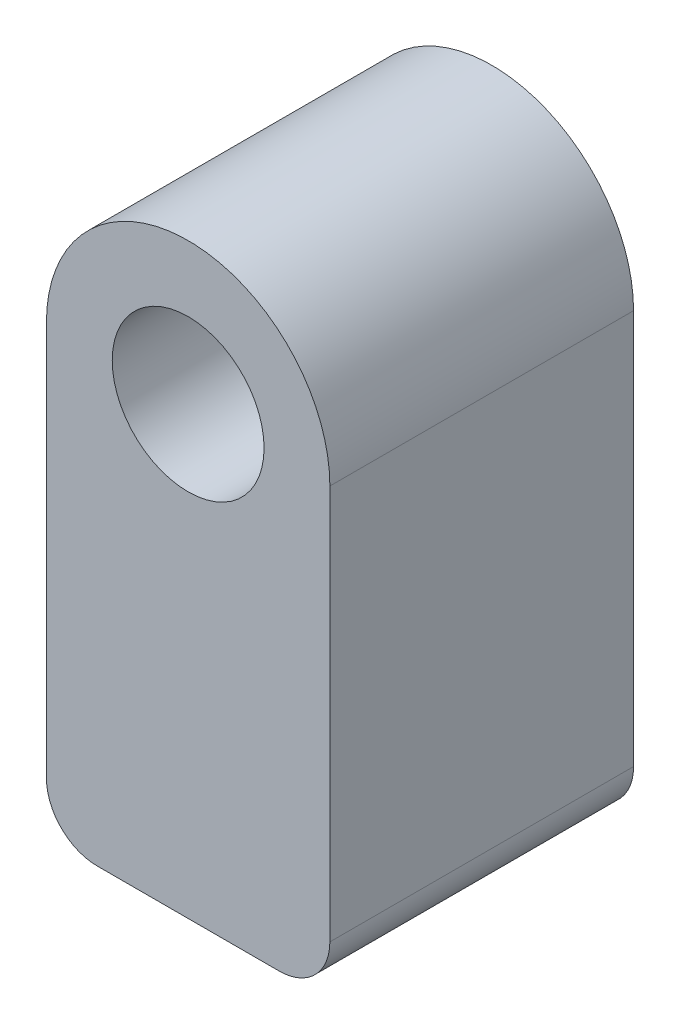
from build123d import *

# Parameters (mm, degrees)
SKETCH1_R           = 9.525
BOSS_EXTRUDE1_DEPTH = 38.1
FILLET1_R           = 6.35


with BuildPart() as part:
    # Sketch1 → Boss-Extrude1 (new body)
    # profile 1 of 4: a face of its own
    with BuildSketch(Plane.XY):
        with BuildLine():
            ThreePointArc((-381, -176.53), (-393.572358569, -171.322358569), (-398.78, -158.75))
            Line((-398.78, -158.75), (-398.78, -176.53))
            Line((-398.78, -176.53), (-381, -176.53))
        make_face()
    # profile 2 of 4: a face of its own
    with BuildSketch(Plane.XY):
        with BuildLine():
            Line((-363.22, -176.53), (-363.22, -158.75))
            ThreePointArc((-363.22, -158.75), (-368.427641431, -171.322358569), (-381, -176.53))
            Line((-381, -176.53), (-363.22, -176.53))
        make_face()
    # profile 3 of 4: a face of its own
    with BuildSketch(Plane.XY):
        with BuildLine():
            Line((-398.78, -158.75), (-363.22, -158.75))
            ThreePointArc((-363.22, -158.75), (-381, -176.53), (-398.78, -158.75))
        make_face()
    # profile 4 of 4: a face of its own
    with BuildSketch(Plane.XY):
        with BuildLine():
            Line((-363.22, -120.65), (-363.22, -158.75))
            Line((-363.22, -158.75), (-398.78, -158.75))
            Line((-398.78, -158.75), (-398.78, -120.65))
            ThreePointArc((-398.78, -120.65), (-381, -102.87), (-363.22, -120.65))
        make_face()
        with Locations(Location((-381, -120.65, 0), (0, 0, 180))):
            Circle(SKETCH1_R, mode=Mode.SUBTRACT)
    extrude(amount=BOSS_EXTRUDE1_DEPTH)

    # Fillet1
    fillet1_edges = [part.edges().sort_by_distance(p)[0] for p in [
        (-398.78, -176.53, 19.05),
        (-363.22, -176.53, 19.05),
    ]]
    fillet(fillet1_edges, radius=FILLET1_R)


solid = part.part
